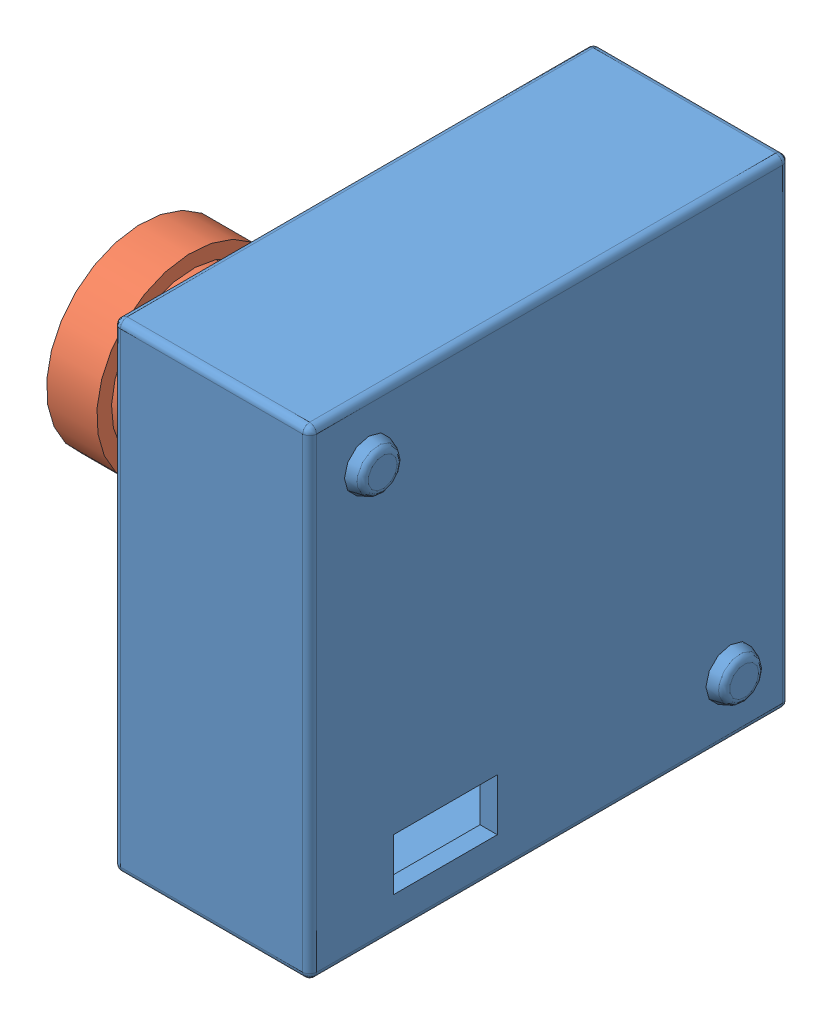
SolidWorks assembly CCD camera.SLDASM, configuration Default (file format 3100). Lengths in mm.
Overall size (30.94 35.2 35.2).
2 component instances, 2 part files, 2 mates.
Components (placement in the parent):
- CCD camera base-1: CCD camera base.SLDPRT [Default] at (-14.6184 9.1117 0) size (21.64 35.2 35.2)
- CCD camera lens-1: CCD camera lens.SLDPRT [Default] at (-26.5818 9.1117 0) x (1 0 0) z (0 0.535089 0.844796) size (20.19 13.97 13.97)
Mates (geometry in assembly coordinates):
- Concentric1: concentric: circle of CCD camera base-1 centre (-20.9684 9.1117 0) axis (-1 0 0); unknown of ?
- Distance1: distance = 5.6134 mm anti-aligned: 
